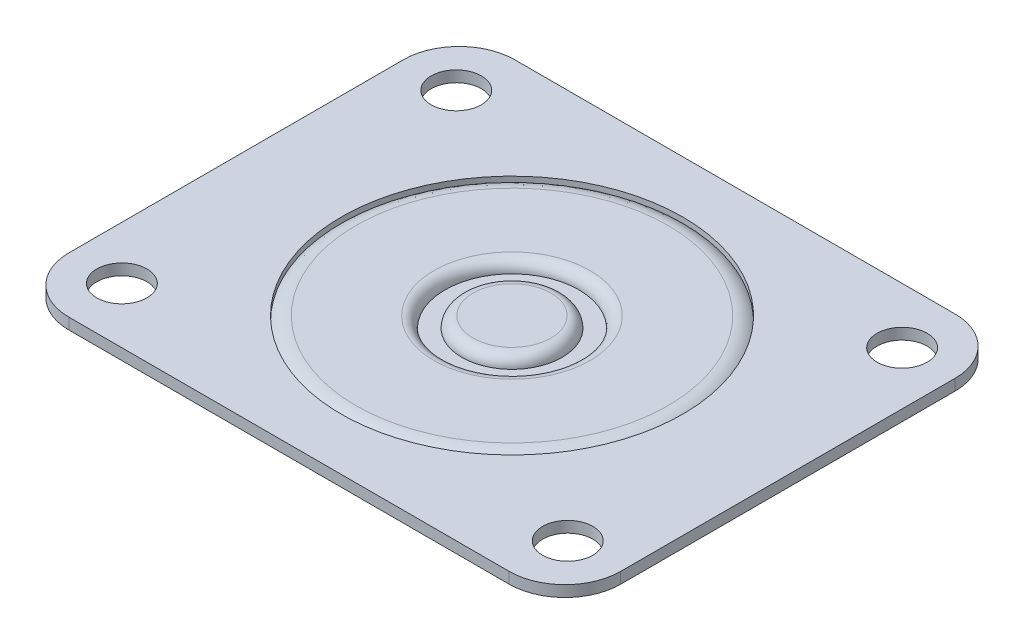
ISO-10303-21;
HEADER;
FILE_DESCRIPTION(('STEP AP214'),'2;1');
FILE_NAME('part.step','',(''),(''),'','','');
FILE_SCHEMA(('AUTOMOTIVE_DESIGN { 1 0 10303 214 1 1 1 1 }'));
ENDSEC;
DATA;
#1=APPLICATION_CONTEXT('core data for automotive mechanical design processes');
#2=APPLICATION_PROTOCOL_DEFINITION('international standard','automotive_design',2000,#1);
#3=PRODUCT_CONTEXT('',#1,'mechanical');
#4=PRODUCT('Part','Part','',(#3));
#5=PRODUCT_RELATED_PRODUCT_CATEGORY('part','',(#4));
#6=PRODUCT_DEFINITION_FORMATION('','',#4);
#7=PRODUCT_DEFINITION_CONTEXT('part definition',#1,'design');
#8=PRODUCT_DEFINITION('design','',#6,#7);
#9=PRODUCT_DEFINITION_SHAPE('','',#8);
#10=(LENGTH_UNIT() NAMED_UNIT(*) SI_UNIT(.MILLI.,.METRE.));
#11=(NAMED_UNIT(*) PLANE_ANGLE_UNIT() SI_UNIT($,.RADIAN.));
#12=(NAMED_UNIT(*) SI_UNIT($,.STERADIAN.) SOLID_ANGLE_UNIT());
#13=UNCERTAINTY_MEASURE_WITH_UNIT(LENGTH_MEASURE(1.E-05),#10,'distance_accuracy_value','');
#14=(GEOMETRIC_REPRESENTATION_CONTEXT(3) GLOBAL_UNCERTAINTY_ASSIGNED_CONTEXT((#13)) GLOBAL_UNIT_ASSIGNED_CONTEXT((#10,
#11,#12)) REPRESENTATION_CONTEXT('',''));
#15=CARTESIAN_POINT('',(0.,0.,0.));
#16=DIRECTION('',(0.,0.,1.));
#17=DIRECTION('',(1.,0.,0.));
#18=AXIS2_PLACEMENT_3D('',#15,#16,#17);
#19=CARTESIAN_POINT('',(0.,-4.,0.));
#20=DIRECTION('',(0.,-1.,0.));
#21=DIRECTION('',(0.,0.,-1.));
#22=AXIS2_PLACEMENT_3D('',#19,#20,#21);
#23=TOROIDAL_SURFACE('',#22,28.,4.);
#24=CARTESIAN_POINT('',(0.,-2.,0.));
#25=DIRECTION('',(0.,-1.,0.));
#26=DIRECTION('',(0.,0.,-1.));
#27=AXIS2_PLACEMENT_3D('',#24,#25,#26);
#28=CIRCLE('',#27,31.4641016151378);
#29=CARTESIAN_POINT('',(0.,-2.,-31.4641016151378));
#30=VERTEX_POINT('',#29);
#31=EDGE_CURVE('E165',#30,#30,#28,.T.);
#32=ORIENTED_EDGE('',*,*,#31,.T.);
#33=EDGE_LOOP('',(#32));
#34=FACE_BOUND('',#33,.T.);
#35=CARTESIAN_POINT('',(0.,-4.,0.));
#36=DIRECTION('',(0.,-1.,0.));
#37=DIRECTION('',(0.,0.,-1.));
#38=AXIS2_PLACEMENT_3D('',#35,#36,#37);
#39=CIRCLE('',#38,32.);
#40=CARTESIAN_POINT('',(0.,-4.,-32.));
#41=VERTEX_POINT('',#40);
#42=EDGE_CURVE('E221',#41,#41,#39,.T.);
#43=ORIENTED_EDGE('',*,*,#42,.F.);
#44=EDGE_LOOP('',(#43));
#45=FACE_BOUND('',#44,.T.);
#46=ADVANCED_FACE('F15',(#34,#45),#23,.T.);
#47=CARTESIAN_POINT('',(0.,-2.,0.));
#48=DIRECTION('',(0.,-1.,0.));
#49=DIRECTION('',(0.,0.,-1.));
#50=AXIS2_PLACEMENT_3D('',#47,#48,#49);
#51=CYLINDRICAL_SURFACE('',#50,32.);
#52=ORIENTED_EDGE('',*,*,#42,.T.);
#53=EDGE_LOOP('',(#52));
#54=FACE_BOUND('',#53,.T.);
#55=CARTESIAN_POINT('',(0.,-9.2,0.));
#56=DIRECTION('',(0.,-1.,0.));
#57=DIRECTION('',(0.,0.,-1.));
#58=AXIS2_PLACEMENT_3D('',#55,#56,#57);
#59=CIRCLE('',#58,32.);
#60=CARTESIAN_POINT('',(0.,-9.2,-32.));
#61=VERTEX_POINT('',#60);
#62=EDGE_CURVE('E217',#61,#61,#59,.T.);
#63=ORIENTED_EDGE('',*,*,#62,.F.);
#64=EDGE_LOOP('',(#63));
#65=FACE_BOUND('',#64,.T.);
#66=ADVANCED_FACE('F264',(#54,#65),#51,.T.);
#67=CARTESIAN_POINT('',(-30.,-9.2,0.));
#68=DIRECTION('',(0.,-1.,0.));
#69=DIRECTION('',(0.,0.,-1.));
#70=AXIS2_PLACEMENT_3D('',#67,#68,#69);
#71=PLANE('',#70);
#72=ORIENTED_EDGE('',*,*,#62,.T.);
#73=EDGE_LOOP('',(#72));
#74=FACE_BOUND('',#73,.T.);
#75=CARTESIAN_POINT('',(0.,-9.2,0.));
#76=DIRECTION('',(0.,-1.,0.));
#77=DIRECTION('',(0.,0.,-1.));
#78=AXIS2_PLACEMENT_3D('',#75,#76,#77);
#79=CIRCLE('',#78,30.);
#80=CARTESIAN_POINT('',(0.,-9.2,-30.));
#81=VERTEX_POINT('',#80);
#82=EDGE_CURVE('E213',#81,#81,#79,.T.);
#83=ORIENTED_EDGE('',*,*,#82,.F.);
#84=EDGE_LOOP('',(#83));
#85=FACE_BOUND('',#84,.T.);
#86=ADVANCED_FACE('F269',(#74,#85),#71,.T.);
#87=CARTESIAN_POINT('',(0.,-2.,0.));
#88=DIRECTION('',(0.,-1.,0.));
#89=DIRECTION('',(0.,0.,-1.));
#90=AXIS2_PLACEMENT_3D('',#87,#88,#89);
#91=CYLINDRICAL_SURFACE('',#90,30.);
#92=ORIENTED_EDGE('',*,*,#82,.T.);
#93=EDGE_LOOP('',(#92));
#94=FACE_BOUND('',#93,.T.);
#95=CARTESIAN_POINT('',(0.,-4.,0.));
#96=DIRECTION('',(0.,-1.,0.));
#97=DIRECTION('',(0.,0.,-1.));
#98=AXIS2_PLACEMENT_3D('',#95,#96,#97);
#99=CIRCLE('',#98,30.);
#100=CARTESIAN_POINT('',(0.,-4.,-30.));
#101=VERTEX_POINT('',#100);
#102=EDGE_CURVE('E209',#101,#101,#99,.T.);
#103=ORIENTED_EDGE('',*,*,#102,.F.);
#104=EDGE_LOOP('',(#103));
#105=FACE_BOUND('',#104,.T.);
#106=ADVANCED_FACE('F279',(#94,#105),#91,.F.);
#107=CARTESIAN_POINT('',(0.,-4.,0.));
#108=DIRECTION('',(0.,-1.,0.));
#109=DIRECTION('',(0.,0.,-1.));
#110=AXIS2_PLACEMENT_3D('',#107,#108,#109);
#111=TOROIDAL_SURFACE('',#110,28.,2.);
#112=ORIENTED_EDGE('',*,*,#102,.T.);
#113=EDGE_LOOP('',(#112));
#114=FACE_BOUND('',#113,.T.);
#115=CARTESIAN_POINT('',(0.,-4.,0.));
#116=DIRECTION('',(0.,-1.,0.));
#117=DIRECTION('',(0.,0.,-1.));
#118=AXIS2_PLACEMENT_3D('',#115,#116,#117);
#119=CIRCLE('',#118,26.);
#120=CARTESIAN_POINT('',(0.,-4.,-26.));
#121=VERTEX_POINT('',#120);
#122=EDGE_CURVE('E205',#121,#121,#119,.T.);
#123=ORIENTED_EDGE('',*,*,#122,.F.);
#124=EDGE_LOOP('',(#123));
#125=FACE_BOUND('',#124,.T.);
#126=ADVANCED_FACE('F285',(#114,#125),#111,.F.);
#127=CARTESIAN_POINT('',(0.,-4.,0.));
#128=DIRECTION('',(0.,-1.,0.));
#129=DIRECTION('',(0.,0.,-1.));
#130=AXIS2_PLACEMENT_3D('',#127,#128,#129);
#131=PLANE('',#130);
#132=ORIENTED_EDGE('',*,*,#122,.T.);
#133=EDGE_LOOP('',(#132));
#134=FACE_BOUND('',#133,.T.);
#135=ADVANCED_FACE('F291',(#134),#131,.T.);
#136=CARTESIAN_POINT('',(-39.5,-2.,-30.));
#137=DIRECTION('',(0.,-1.,0.));
#138=DIRECTION('',(1.,0.,0.));
#139=AXIS2_PLACEMENT_3D('',#136,#137,#138);
#140=PLANE('',#139);
#141=CARTESIAN_POINT('',(40.,-2.,30.));
#142=DIRECTION('',(0.,-1.,0.));
#143=DIRECTION('',(1.,0.,0.));
#144=AXIS2_PLACEMENT_3D('',#141,#142,#143);
#145=CIRCLE('',#144,4.5);
#146=CARTESIAN_POINT('',(44.5,-2.,30.));
#147=VERTEX_POINT('',#146);
#148=EDGE_CURVE('E196',#147,#147,#145,.T.);
#149=ORIENTED_EDGE('',*,*,#148,.F.);
#150=EDGE_LOOP('',(#149));
#151=FACE_BOUND('',#150,.T.);
#152=CARTESIAN_POINT('',(40.,-2.,-30.));
#153=DIRECTION('',(0.,-1.,0.));
#154=DIRECTION('',(1.,0.,0.));
#155=AXIS2_PLACEMENT_3D('',#152,#153,#154);
#156=CIRCLE('',#155,4.5);
#157=CARTESIAN_POINT('',(44.5,-2.,-30.));
#158=VERTEX_POINT('',#157);
#159=EDGE_CURVE('E191',#158,#158,#156,.T.);
#160=ORIENTED_EDGE('',*,*,#159,.F.);
#161=EDGE_LOOP('',(#160));
#162=FACE_BOUND('',#161,.T.);
#163=CARTESIAN_POINT('',(-40.,-2.,30.));
#164=DIRECTION('',(0.,-1.,0.));
#165=DIRECTION('',(1.,0.,0.));
#166=AXIS2_PLACEMENT_3D('',#163,#164,#165);
#167=CIRCLE('',#166,4.5);
#168=CARTESIAN_POINT('',(-35.5,-2.,30.));
#169=VERTEX_POINT('',#168);
#170=EDGE_CURVE('E186',#169,#169,#167,.T.);
#171=ORIENTED_EDGE('',*,*,#170,.F.);
#172=EDGE_LOOP('',(#171));
#173=FACE_BOUND('',#172,.T.);
#174=CARTESIAN_POINT('',(-40.,-2.,-30.));
#175=DIRECTION('',(0.,-1.,0.));
#176=DIRECTION('',(1.,0.,0.));
#177=AXIS2_PLACEMENT_3D('',#174,#175,#176);
#178=CIRCLE('',#177,4.5);
#179=CARTESIAN_POINT('',(-35.5,-2.,-30.));
#180=VERTEX_POINT('',#179);
#181=EDGE_CURVE('E139',#180,#180,#178,.T.);
#182=ORIENTED_EDGE('',*,*,#181,.F.);
#183=EDGE_LOOP('',(#182));
#184=FACE_BOUND('',#183,.T.);
#185=DIRECTION('',(-1.,0.,0.));
#186=VECTOR('',#185,1.);
#187=CARTESIAN_POINT('',(39.5,-2.,-40.));
#188=LINE('',#187,#186);
#189=CARTESIAN_POINT('',(39.5,-2.,-40.));
#190=VERTEX_POINT('',#189);
#191=CARTESIAN_POINT('',(-39.5,-2.,-40.));
#192=VERTEX_POINT('',#191);
#193=EDGE_CURVE('E136',#190,#192,#188,.T.);
#194=ORIENTED_EDGE('',*,*,#193,.F.);
#195=CARTESIAN_POINT('',(39.5,-2.,-30.));
#196=DIRECTION('',(0.,-1.,0.));
#197=DIRECTION('',(1.,0.,0.));
#198=AXIS2_PLACEMENT_3D('',#195,#196,#197);
#199=CIRCLE('',#198,10.);
#200=CARTESIAN_POINT('',(49.5,-2.,-30.));
#201=VERTEX_POINT('',#200);
#202=EDGE_CURVE('E38',#190,#201,#199,.T.);
#203=ORIENTED_EDGE('',*,*,#202,.T.);
#204=DIRECTION('',(0.,0.,-1.));
#205=VECTOR('',#204,1.);
#206=CARTESIAN_POINT('',(49.5,-2.,30.));
#207=LINE('',#206,#205);
#208=CARTESIAN_POINT('',(49.5,-2.,30.));
#209=VERTEX_POINT('',#208);
#210=EDGE_CURVE('E155',#209,#201,#207,.T.);
#211=ORIENTED_EDGE('',*,*,#210,.F.);
#212=CARTESIAN_POINT('',(39.5,-2.,30.));
#213=DIRECTION('',(0.,-1.,0.));
#214=DIRECTION('',(1.,0.,0.));
#215=AXIS2_PLACEMENT_3D('',#212,#213,#214);
#216=CIRCLE('',#215,10.);
#217=CARTESIAN_POINT('',(39.5,-2.,40.));
#218=VERTEX_POINT('',#217);
#219=EDGE_CURVE('E152',#209,#218,#216,.T.);
#220=ORIENTED_EDGE('',*,*,#219,.T.);
#221=DIRECTION('',(1.,0.,0.));
#222=VECTOR('',#221,1.);
#223=CARTESIAN_POINT('',(-39.5,-2.,40.));
#224=LINE('',#223,#222);
#225=CARTESIAN_POINT('',(-39.5,-2.,40.));
#226=VERTEX_POINT('',#225);
#227=EDGE_CURVE('E148',#226,#218,#224,.T.);
#228=ORIENTED_EDGE('',*,*,#227,.F.);
#229=CARTESIAN_POINT('',(-39.5,-2.,30.));
#230=DIRECTION('',(0.,-1.,0.));
#231=DIRECTION('',(1.,0.,0.));
#232=AXIS2_PLACEMENT_3D('',#229,#230,#231);
#233=CIRCLE('',#232,10.);
#234=CARTESIAN_POINT('',(-49.5,-2.,30.));
#235=VERTEX_POINT('',#234);
#236=EDGE_CURVE('E145',#226,#235,#233,.T.);
#237=ORIENTED_EDGE('',*,*,#236,.T.);
#238=DIRECTION('',(0.,0.,1.));
#239=VECTOR('',#238,1.);
#240=CARTESIAN_POINT('',(-49.5,-2.,-30.));
#241=LINE('',#240,#239);
#242=CARTESIAN_POINT('',(-49.5,-2.,-30.));
#243=VERTEX_POINT('',#242);
#244=EDGE_CURVE('E142',#243,#235,#241,.T.);
#245=ORIENTED_EDGE('',*,*,#244,.F.);
#246=CARTESIAN_POINT('',(-39.5,-2.,-30.));
#247=DIRECTION('',(0.,-1.,0.));
#248=DIRECTION('',(1.,0.,0.));
#249=AXIS2_PLACEMENT_3D('',#246,#247,#248);
#250=CIRCLE('',#249,10.);
#251=EDGE_CURVE('E89',#243,#192,#250,.T.);
#252=ORIENTED_EDGE('',*,*,#251,.T.);
#253=EDGE_LOOP('',(#194,#203,#211,#220,#228,#237,#245,#252));
#254=FACE_BOUND('',#253,.T.);
#255=ORIENTED_EDGE('',*,*,#31,.F.);
#256=EDGE_LOOP('',(#255));
#257=FACE_BOUND('',#256,.T.);
#258=ADVANCED_FACE('F296',(#151,#162,#173,#184,#254,#257),#140,.T.);
#259=CARTESIAN_POINT('',(39.5,-2.,-40.));
#260=DIRECTION('',(0.,0.,-1.));
#261=DIRECTION('',(0.,1.,0.));
#262=AXIS2_PLACEMENT_3D('',#259,#260,#261);
#263=PLANE('',#262);
#264=DIRECTION('',(-1.,0.,0.));
#265=VECTOR('',#264,1.);
#266=CARTESIAN_POINT('',(39.5,0.,-40.));
#267=LINE('',#266,#265);
#268=CARTESIAN_POINT('',(39.5,0.,-40.));
#269=VERTEX_POINT('',#268);
#270=CARTESIAN_POINT('',(-39.5,0.,-40.));
#271=VERTEX_POINT('',#270);
#272=EDGE_CURVE('E104',#269,#271,#267,.T.);
#273=ORIENTED_EDGE('',*,*,#272,.F.);
#274=DIRECTION('',(0.,1.,0.));
#275=VECTOR('',#274,1.);
#276=CARTESIAN_POINT('',(39.5,-2.,-40.));
#277=LINE('',#276,#275);
#278=EDGE_CURVE('E31',#190,#269,#277,.T.);
#279=ORIENTED_EDGE('',*,*,#278,.F.);
#280=ORIENTED_EDGE('',*,*,#193,.T.);
#281=DIRECTION('',(0.,1.,0.));
#282=VECTOR('',#281,1.);
#283=CARTESIAN_POINT('',(-39.5,-2.,-40.));
#284=LINE('',#283,#282);
#285=EDGE_CURVE('E96',#192,#271,#284,.T.);
#286=ORIENTED_EDGE('',*,*,#285,.T.);
#287=EDGE_LOOP('',(#273,#279,#280,#286));
#288=FACE_BOUND('',#287,.T.);
#289=ADVANCED_FACE('F301',(#288),#263,.T.);
#290=CARTESIAN_POINT('',(39.5,-2.,-30.));
#291=DIRECTION('',(0.,1.,0.));
#292=DIRECTION('',(-1.,0.,0.));
#293=AXIS2_PLACEMENT_3D('',#290,#291,#292);
#294=CYLINDRICAL_SURFACE('',#293,10.);
#295=CARTESIAN_POINT('',(39.5,0.,-30.));
#296=DIRECTION('',(0.,-1.,0.));
#297=DIRECTION('',(1.,0.,0.));
#298=AXIS2_PLACEMENT_3D('',#295,#296,#297);
#299=CIRCLE('',#298,10.);
#300=CARTESIAN_POINT('',(49.5,0.,-30.));
#301=VERTEX_POINT('',#300);
#302=EDGE_CURVE('E132',#269,#301,#299,.T.);
#303=ORIENTED_EDGE('',*,*,#302,.T.);
#304=DIRECTION('',(0.,1.,0.));
#305=VECTOR('',#304,1.);
#306=CARTESIAN_POINT('',(49.5,-2.,-30.));
#307=LINE('',#306,#305);
#308=EDGE_CURVE('E166',#201,#301,#307,.T.);
#309=ORIENTED_EDGE('',*,*,#308,.F.);
#310=ORIENTED_EDGE('',*,*,#202,.F.);
#311=ORIENTED_EDGE('',*,*,#278,.T.);
#312=EDGE_LOOP('',(#303,#309,#310,#311));
#313=FACE_BOUND('',#312,.T.);
#314=ADVANCED_FACE('F307',(#313),#294,.T.);
#315=CARTESIAN_POINT('',(49.5,-2.,30.));
#316=DIRECTION('',(1.,0.,0.));
#317=DIRECTION('',(0.,1.,0.));
#318=AXIS2_PLACEMENT_3D('',#315,#316,#317);
#319=PLANE('',#318);
#320=DIRECTION('',(0.,0.,-1.));
#321=VECTOR('',#320,1.);
#322=CARTESIAN_POINT('',(49.5,0.,30.));
#323=LINE('',#322,#321);
#324=CARTESIAN_POINT('',(49.5,0.,30.));
#325=VERTEX_POINT('',#324);
#326=EDGE_CURVE('E128',#325,#301,#323,.T.);
#327=ORIENTED_EDGE('',*,*,#326,.F.);
#328=DIRECTION('',(0.,1.,0.));
#329=VECTOR('',#328,1.);
#330=CARTESIAN_POINT('',(49.5,-2.,30.));
#331=LINE('',#330,#329);
#332=EDGE_CURVE('E169',#209,#325,#331,.T.);
#333=ORIENTED_EDGE('',*,*,#332,.F.);
#334=ORIENTED_EDGE('',*,*,#210,.T.);
#335=ORIENTED_EDGE('',*,*,#308,.T.);
#336=EDGE_LOOP('',(#327,#333,#334,#335));
#337=FACE_BOUND('',#336,.T.);
#338=ADVANCED_FACE('F323',(#337),#319,.T.);
#339=CARTESIAN_POINT('',(39.5,-2.,30.));
#340=DIRECTION('',(0.,1.,0.));
#341=DIRECTION('',(-1.,0.,0.));
#342=AXIS2_PLACEMENT_3D('',#339,#340,#341);
#343=CYLINDRICAL_SURFACE('',#342,10.);
#344=CARTESIAN_POINT('',(39.5,0.,30.));
#345=DIRECTION('',(0.,-1.,0.));
#346=DIRECTION('',(1.,0.,0.));
#347=AXIS2_PLACEMENT_3D('',#344,#345,#346);
#348=CIRCLE('',#347,10.);
#349=CARTESIAN_POINT('',(39.5,0.,40.));
#350=VERTEX_POINT('',#349);
#351=EDGE_CURVE('E124',#325,#350,#348,.T.);
#352=ORIENTED_EDGE('',*,*,#351,.T.);
#353=DIRECTION('',(0.,1.,0.));
#354=VECTOR('',#353,1.);
#355=CARTESIAN_POINT('',(39.5,-2.,40.));
#356=LINE('',#355,#354);
#357=EDGE_CURVE('E172',#218,#350,#356,.T.);
#358=ORIENTED_EDGE('',*,*,#357,.F.);
#359=ORIENTED_EDGE('',*,*,#219,.F.);
#360=ORIENTED_EDGE('',*,*,#332,.T.);
#361=EDGE_LOOP('',(#352,#358,#359,#360));
#362=FACE_BOUND('',#361,.T.);
#363=ADVANCED_FACE('F319',(#362),#343,.T.);
#364=CARTESIAN_POINT('',(-39.5,-2.,40.));
#365=DIRECTION('',(0.,0.,1.));
#366=DIRECTION('',(0.,-1.,0.));
#367=AXIS2_PLACEMENT_3D('',#364,#365,#366);
#368=PLANE('',#367);
#369=DIRECTION('',(1.,0.,0.));
#370=VECTOR('',#369,1.);
#371=CARTESIAN_POINT('',(-39.5,0.,40.));
#372=LINE('',#371,#370);
#373=CARTESIAN_POINT('',(-39.5,0.,40.));
#374=VERTEX_POINT('',#373);
#375=EDGE_CURVE('E117',#374,#350,#372,.T.);
#376=ORIENTED_EDGE('',*,*,#375,.F.);
#377=DIRECTION('',(0.,1.,0.));
#378=VECTOR('',#377,1.);
#379=CARTESIAN_POINT('',(-39.5,-2.,40.));
#380=LINE('',#379,#378);
#381=EDGE_CURVE('E175',#226,#374,#380,.T.);
#382=ORIENTED_EDGE('',*,*,#381,.F.);
#383=ORIENTED_EDGE('',*,*,#227,.T.);
#384=ORIENTED_EDGE('',*,*,#357,.T.);
#385=EDGE_LOOP('',(#376,#382,#383,#384));
#386=FACE_BOUND('',#385,.T.);
#387=ADVANCED_FACE('F315',(#386),#368,.T.);
#388=CARTESIAN_POINT('',(-39.5,-2.,30.));
#389=DIRECTION('',(0.,1.,0.));
#390=DIRECTION('',(-1.,0.,0.));
#391=AXIS2_PLACEMENT_3D('',#388,#389,#390);
#392=CYLINDRICAL_SURFACE('',#391,10.);
#393=CARTESIAN_POINT('',(-39.5,0.,30.));
#394=DIRECTION('',(0.,-1.,0.));
#395=DIRECTION('',(1.,0.,0.));
#396=AXIS2_PLACEMENT_3D('',#393,#394,#395);
#397=CIRCLE('',#396,10.);
#398=CARTESIAN_POINT('',(-49.5,0.,30.));
#399=VERTEX_POINT('',#398);
#400=EDGE_CURVE('E111',#374,#399,#397,.T.);
#401=ORIENTED_EDGE('',*,*,#400,.T.);
#402=DIRECTION('',(0.,1.,0.));
#403=VECTOR('',#402,1.);
#404=CARTESIAN_POINT('',(-49.5,-2.,30.));
#405=LINE('',#404,#403);
#406=EDGE_CURVE('E95',#235,#399,#405,.T.);
#407=ORIENTED_EDGE('',*,*,#406,.F.);
#408=ORIENTED_EDGE('',*,*,#236,.F.);
#409=ORIENTED_EDGE('',*,*,#381,.T.);
#410=EDGE_LOOP('',(#401,#407,#408,#409));
#411=FACE_BOUND('',#410,.T.);
#412=ADVANCED_FACE('F312',(#411),#392,.T.);
#413=CARTESIAN_POINT('',(-49.5,-2.,-30.));
#414=DIRECTION('',(-1.,0.,0.));
#415=DIRECTION('',(0.,-1.,0.));
#416=AXIS2_PLACEMENT_3D('',#413,#414,#415);
#417=PLANE('',#416);
#418=DIRECTION('',(0.,0.,1.));
#419=VECTOR('',#418,1.);
#420=CARTESIAN_POINT('',(-49.5,0.,-30.));
#421=LINE('',#420,#419);
#422=CARTESIAN_POINT('',(-49.5,0.,-30.));
#423=VERTEX_POINT('',#422);
#424=EDGE_CURVE('E102',#423,#399,#421,.T.);
#425=ORIENTED_EDGE('',*,*,#424,.F.);
#426=DIRECTION('',(0.,1.,0.));
#427=VECTOR('',#426,1.);
#428=CARTESIAN_POINT('',(-49.5,-2.,-30.));
#429=LINE('',#428,#427);
#430=EDGE_CURVE('E83',#243,#423,#429,.T.);
#431=ORIENTED_EDGE('',*,*,#430,.F.);
#432=ORIENTED_EDGE('',*,*,#244,.T.);
#433=ORIENTED_EDGE('',*,*,#406,.T.);
#434=EDGE_LOOP('',(#425,#431,#432,#433));
#435=FACE_BOUND('',#434,.T.);
#436=ADVANCED_FACE('F107',(#435),#417,.T.);
#437=CARTESIAN_POINT('',(-39.5,-2.,-30.));
#438=DIRECTION('',(0.,1.,0.));
#439=DIRECTION('',(-1.,0.,0.));
#440=AXIS2_PLACEMENT_3D('',#437,#438,#439);
#441=CYLINDRICAL_SURFACE('',#440,10.);
#442=CARTESIAN_POINT('',(-39.5,0.,-30.));
#443=DIRECTION('',(0.,-1.,0.));
#444=DIRECTION('',(1.,0.,0.));
#445=AXIS2_PLACEMENT_3D('',#442,#443,#444);
#446=CIRCLE('',#445,10.);
#447=EDGE_CURVE('E87',#423,#271,#446,.T.);
#448=ORIENTED_EDGE('',*,*,#447,.T.);
#449=ORIENTED_EDGE('',*,*,#285,.F.);
#450=ORIENTED_EDGE('',*,*,#251,.F.);
#451=ORIENTED_EDGE('',*,*,#430,.T.);
#452=EDGE_LOOP('',(#448,#449,#450,#451));
#453=FACE_BOUND('',#452,.T.);
#454=ADVANCED_FACE('F85',(#453),#441,.T.);
#455=CARTESIAN_POINT('',(-39.5,0.,-30.));
#456=DIRECTION('',(0.,-1.,0.));
#457=DIRECTION('',(1.,0.,0.));
#458=AXIS2_PLACEMENT_3D('',#455,#456,#457);
#459=PLANE('',#458);
#460=CARTESIAN_POINT('',(0.,0.,0.));
#461=DIRECTION('',(0.,-1.,0.));
#462=DIRECTION('',(0.,0.,-1.));
#463=AXIS2_PLACEMENT_3D('',#460,#461,#462);
#464=CIRCLE('',#463,30.6457513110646);
#465=CARTESIAN_POINT('',(0.,0.,-30.6457513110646));
#466=VERTEX_POINT('',#465);
#467=EDGE_CURVE('E201',#466,#466,#464,.T.);
#468=ORIENTED_EDGE('',*,*,#467,.T.);
#469=EDGE_LOOP('',(#468));
#470=FACE_BOUND('',#469,.T.);
#471=CARTESIAN_POINT('',(40.,0.,30.));
#472=DIRECTION('',(0.,-1.,0.));
#473=DIRECTION('',(1.,0.,0.));
#474=AXIS2_PLACEMENT_3D('',#471,#472,#473);
#475=CIRCLE('',#474,4.5);
#476=CARTESIAN_POINT('',(44.5,0.,30.));
#477=VERTEX_POINT('',#476);
#478=EDGE_CURVE('E197',#477,#477,#475,.T.);
#479=ORIENTED_EDGE('',*,*,#478,.T.);
#480=EDGE_LOOP('',(#479));
#481=FACE_BOUND('',#480,.T.);
#482=CARTESIAN_POINT('',(40.,0.,-30.));
#483=DIRECTION('',(0.,-1.,0.));
#484=DIRECTION('',(1.,0.,0.));
#485=AXIS2_PLACEMENT_3D('',#482,#483,#484);
#486=CIRCLE('',#485,4.5);
#487=CARTESIAN_POINT('',(44.5,0.,-30.));
#488=VERTEX_POINT('',#487);
#489=EDGE_CURVE('E192',#488,#488,#486,.T.);
#490=ORIENTED_EDGE('',*,*,#489,.T.);
#491=EDGE_LOOP('',(#490));
#492=FACE_BOUND('',#491,.T.);
#493=CARTESIAN_POINT('',(-40.,0.,30.));
#494=DIRECTION('',(0.,-1.,0.));
#495=DIRECTION('',(1.,0.,0.));
#496=AXIS2_PLACEMENT_3D('',#493,#494,#495);
#497=CIRCLE('',#496,4.5);
#498=CARTESIAN_POINT('',(-35.5,0.,30.));
#499=VERTEX_POINT('',#498);
#500=EDGE_CURVE('E187',#499,#499,#497,.T.);
#501=ORIENTED_EDGE('',*,*,#500,.T.);
#502=EDGE_LOOP('',(#501));
#503=FACE_BOUND('',#502,.T.);
#504=CARTESIAN_POINT('',(-40.,0.,-30.));
#505=DIRECTION('',(0.,-1.,0.));
#506=DIRECTION('',(1.,0.,0.));
#507=AXIS2_PLACEMENT_3D('',#504,#505,#506);
#508=CIRCLE('',#507,4.5);
#509=CARTESIAN_POINT('',(-35.5,0.,-30.));
#510=VERTEX_POINT('',#509);
#511=EDGE_CURVE('E182',#510,#510,#508,.T.);
#512=ORIENTED_EDGE('',*,*,#511,.T.);
#513=EDGE_LOOP('',(#512));
#514=FACE_BOUND('',#513,.T.);
#515=ORIENTED_EDGE('',*,*,#272,.T.);
#516=ORIENTED_EDGE('',*,*,#447,.F.);
#517=ORIENTED_EDGE('',*,*,#424,.T.);
#518=ORIENTED_EDGE('',*,*,#400,.F.);
#519=ORIENTED_EDGE('',*,*,#375,.T.);
#520=ORIENTED_EDGE('',*,*,#351,.F.);
#521=ORIENTED_EDGE('',*,*,#326,.T.);
#522=ORIENTED_EDGE('',*,*,#302,.F.);
#523=EDGE_LOOP('',(#515,#516,#517,#518,#519,#520,#521,#522));
#524=FACE_BOUND('',#523,.T.);
#525=ADVANCED_FACE('F100',(#470,#481,#492,#503,#514,#524),#459,.F.);
#526=CARTESIAN_POINT('',(-40.,1.,-30.));
#527=DIRECTION('',(0.,-1.,0.));
#528=DIRECTION('',(0.,0.,1.));
#529=AXIS2_PLACEMENT_3D('',#526,#527,#528);
#530=CYLINDRICAL_SURFACE('',#529,4.5);
#531=ORIENTED_EDGE('',*,*,#181,.T.);
#532=EDGE_LOOP('',(#531));
#533=FACE_BOUND('',#532,.T.);
#534=ORIENTED_EDGE('',*,*,#511,.F.);
#535=EDGE_LOOP('',(#534));
#536=FACE_BOUND('',#535,.T.);
#537=ADVANCED_FACE('F333',(#533,#536),#530,.F.);
#538=CARTESIAN_POINT('',(-40.,1.,30.));
#539=DIRECTION('',(0.,-1.,0.));
#540=DIRECTION('',(0.,0.,1.));
#541=AXIS2_PLACEMENT_3D('',#538,#539,#540);
#542=CYLINDRICAL_SURFACE('',#541,4.5);
#543=ORIENTED_EDGE('',*,*,#170,.T.);
#544=EDGE_LOOP('',(#543));
#545=FACE_BOUND('',#544,.T.);
#546=ORIENTED_EDGE('',*,*,#500,.F.);
#547=EDGE_LOOP('',(#546));
#548=FACE_BOUND('',#547,.T.);
#549=ADVANCED_FACE('F337',(#545,#548),#542,.F.);
#550=CARTESIAN_POINT('',(40.,1.,-30.));
#551=DIRECTION('',(0.,-1.,0.));
#552=DIRECTION('',(0.,0.,1.));
#553=AXIS2_PLACEMENT_3D('',#550,#551,#552);
#554=CYLINDRICAL_SURFACE('',#553,4.5);
#555=ORIENTED_EDGE('',*,*,#159,.T.);
#556=EDGE_LOOP('',(#555));
#557=FACE_BOUND('',#556,.T.);
#558=ORIENTED_EDGE('',*,*,#489,.F.);
#559=EDGE_LOOP('',(#558));
#560=FACE_BOUND('',#559,.T.);
#561=ADVANCED_FACE('F341',(#557,#560),#554,.F.);
#562=CARTESIAN_POINT('',(40.,1.,30.));
#563=DIRECTION('',(0.,-1.,0.));
#564=DIRECTION('',(0.,0.,1.));
#565=AXIS2_PLACEMENT_3D('',#562,#563,#564);
#566=CYLINDRICAL_SURFACE('',#565,4.5);
#567=ORIENTED_EDGE('',*,*,#148,.T.);
#568=EDGE_LOOP('',(#567));
#569=FACE_BOUND('',#568,.T.);
#570=ORIENTED_EDGE('',*,*,#478,.F.);
#571=EDGE_LOOP('',(#570));
#572=FACE_BOUND('',#571,.T.);
#573=ADVANCED_FACE('F345',(#569,#572),#566,.F.);
#574=CARTESIAN_POINT('',(0.,0.,0.));
#575=DIRECTION('',(0.,-1.,0.));
#576=DIRECTION('',(0.,0.,-1.));
#577=AXIS2_PLACEMENT_3D('',#574,#575,#576);
#578=CYLINDRICAL_SURFACE('',#577,30.6457513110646);
#579=ORIENTED_EDGE('',*,*,#467,.F.);
#580=EDGE_LOOP('',(#579));
#581=FACE_BOUND('',#580,.T.);
#582=CARTESIAN_POINT('',(0.,-1.,0.));
#583=DIRECTION('',(0.,-1.,0.));
#584=DIRECTION('',(0.,0.,-1.));
#585=AXIS2_PLACEMENT_3D('',#582,#583,#584);
#586=CIRCLE('',#585,30.6457513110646);
#587=CARTESIAN_POINT('',(0.,-1.,-30.6457513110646));
#588=VERTEX_POINT('',#587);
#589=EDGE_CURVE('E24',#588,#588,#586,.T.);
#590=ORIENTED_EDGE('',*,*,#589,.T.);
#591=EDGE_LOOP('',(#590));
#592=FACE_BOUND('',#591,.T.);
#593=ADVANCED_FACE('F243',(#581,#592),#578,.F.);
#594=CARTESIAN_POINT('',(-12.,-2.,0.));
#595=DIRECTION('',(0.,1.,0.));
#596=DIRECTION('',(0.,0.,1.));
#597=AXIS2_PLACEMENT_3D('',#594,#595,#596);
#598=PLANE('',#597);
#599=CARTESIAN_POINT('',(0.,-2.,0.));
#600=DIRECTION('',(0.,1.,0.));
#601=DIRECTION('',(0.,0.,1.));
#602=AXIS2_PLACEMENT_3D('',#599,#600,#601);
#603=CIRCLE('',#602,9.);
#604=CARTESIAN_POINT('',(0.,-2.,9.));
#605=VERTEX_POINT('',#604);
#606=EDGE_CURVE('E10',#605,#605,#603,.T.);
#607=ORIENTED_EDGE('',*,*,#606,.F.);
#608=EDGE_LOOP('',(#607));
#609=FACE_BOUND('',#608,.T.);
#610=CARTESIAN_POINT('',(0.,-2.,0.));
#611=DIRECTION('',(0.,-1.,0.));
#612=DIRECTION('',(0.,0.,-1.));
#613=AXIS2_PLACEMENT_3D('',#610,#611,#612);
#614=CIRCLE('',#613,12.);
#615=CARTESIAN_POINT('',(0.,-2.,-12.));
#616=VERTEX_POINT('',#615);
#617=EDGE_CURVE('E233',#616,#616,#614,.T.);
#618=ORIENTED_EDGE('',*,*,#617,.F.);
#619=EDGE_LOOP('',(#618));
#620=FACE_BOUND('',#619,.T.);
#621=ADVANCED_FACE('F17',(#609,#620),#598,.T.);
#622=CARTESIAN_POINT('',(0.,-2.,0.));
#623=DIRECTION('',(0.,-1.,0.));
#624=DIRECTION('',(0.,0.,-1.));
#625=AXIS2_PLACEMENT_3D('',#622,#623,#624);
#626=TOROIDAL_SURFACE('',#625,14.,2.);
#627=CARTESIAN_POINT('',(0.,0.,0.));
#628=DIRECTION('',(0.,-1.,0.));
#629=DIRECTION('',(0.,0.,-1.));
#630=AXIS2_PLACEMENT_3D('',#627,#628,#629);
#631=CIRCLE('',#630,14.);
#632=CARTESIAN_POINT('',(0.,0.,-14.));
#633=VERTEX_POINT('',#632);
#634=EDGE_CURVE('E229',#633,#633,#631,.T.);
#635=ORIENTED_EDGE('',*,*,#634,.F.);
#636=EDGE_LOOP('',(#635));
#637=FACE_BOUND('',#636,.T.);
#638=ORIENTED_EDGE('',*,*,#617,.T.);
#639=EDGE_LOOP('',(#638));
#640=FACE_BOUND('',#639,.T.);
#641=ADVANCED_FACE('F259',(#637,#640),#626,.T.);
#642=CARTESIAN_POINT('',(-28.,0.,0.));
#643=DIRECTION('',(0.,1.,0.));
#644=DIRECTION('',(0.,0.,1.));
#645=AXIS2_PLACEMENT_3D('',#642,#643,#644);
#646=PLANE('',#645);
#647=ORIENTED_EDGE('',*,*,#634,.T.);
#648=EDGE_LOOP('',(#647));
#649=FACE_BOUND('',#648,.T.);
#650=CARTESIAN_POINT('',(0.,0.,0.));
#651=DIRECTION('',(0.,-1.,0.));
#652=DIRECTION('',(0.,0.,-1.));
#653=AXIS2_PLACEMENT_3D('',#650,#651,#652);
#654=CIRCLE('',#653,28.);
#655=CARTESIAN_POINT('',(0.,0.,-28.));
#656=VERTEX_POINT('',#655);
#657=EDGE_CURVE('E225',#656,#656,#654,.T.);
#658=ORIENTED_EDGE('',*,*,#657,.F.);
#659=EDGE_LOOP('',(#658));
#660=FACE_BOUND('',#659,.T.);
#661=ADVANCED_FACE('F248',(#649,#660),#646,.T.);
#662=ORIENTED_EDGE('',*,*,#657,.T.);
#663=EDGE_LOOP('',(#662));
#664=FACE_BOUND('',#663,.T.);
#665=ORIENTED_EDGE('',*,*,#589,.F.);
#666=EDGE_LOOP('',(#665));
#667=FACE_BOUND('',#666,.T.);
#668=ADVANCED_FACE('F245',(#664,#667),#23,.T.);
#669=CARTESIAN_POINT('',(0.,-2.,0.));
#670=DIRECTION('',(0.,-1.,0.));
#671=DIRECTION('',(0.,0.,-1.));
#672=AXIS2_PLACEMENT_3D('',#669,#670,#671);
#673=TOROIDAL_SURFACE('',#672,7.,2.);
#674=CARTESIAN_POINT('',(0.,0.,0.));
#675=DIRECTION('',(0.,-1.,0.));
#676=DIRECTION('',(0.,0.,-1.));
#677=AXIS2_PLACEMENT_3D('',#674,#675,#676);
#678=CIRCLE('',#677,7.);
#679=CARTESIAN_POINT('',(0.,0.,-7.));
#680=VERTEX_POINT('',#679);
#681=EDGE_CURVE('E359',#680,#680,#678,.T.);
#682=ORIENTED_EDGE('',*,*,#681,.T.);
#683=EDGE_LOOP('',(#682));
#684=FACE_BOUND('',#683,.T.);
#685=ORIENTED_EDGE('',*,*,#606,.T.);
#686=EDGE_LOOP('',(#685));
#687=FACE_BOUND('',#686,.T.);
#688=ADVANCED_FACE('F247',(#684,#687),#673,.T.);
#689=CARTESIAN_POINT('',(0.,0.,0.));
#690=DIRECTION('',(0.,-1.,0.));
#691=DIRECTION('',(0.,0.,-1.));
#692=AXIS2_PLACEMENT_3D('',#689,#690,#691);
#693=PLANE('',#692);
#694=ORIENTED_EDGE('',*,*,#681,.F.);
#695=EDGE_LOOP('',(#694));
#696=FACE_BOUND('',#695,.T.);
#697=ADVANCED_FACE('F256',(#696),#693,.F.);
#698=CLOSED_SHELL('',(#46,#66,#86,#106,#126,#135,#258,#289,#314,#338,#363,#387,#412,#436,#454,
#525,#537,#549,#561,#573,#593,#621,#641,#661,#668,#688,#697));
#699=MANIFOLD_SOLID_BREP('B1',#698);
#700=ADVANCED_BREP_SHAPE_REPRESENTATION('',(#18,#699),#14);
#701=SHAPE_DEFINITION_REPRESENTATION(#9,#700);
ENDSEC;
END-ISO-10303-21;
